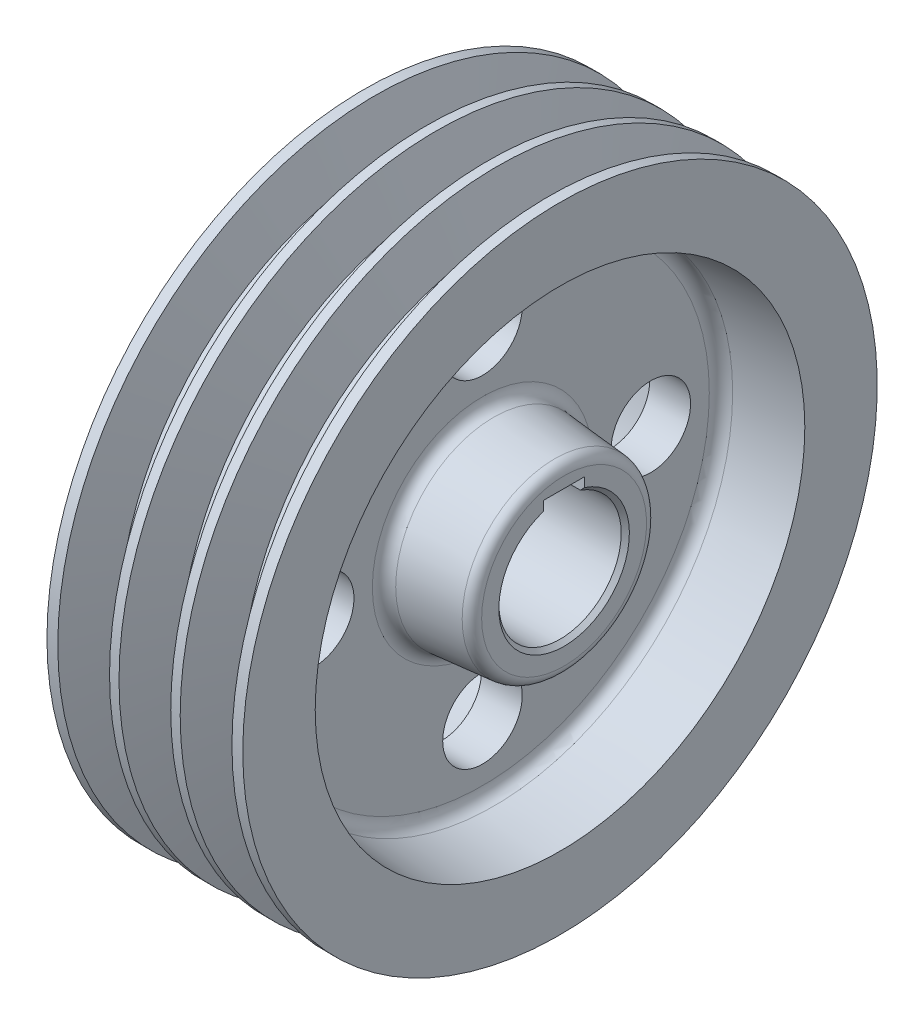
from build123d import *

# Parameters (mm, degrees)
PATTERN_LINEAR_936_COUNT    = 3
PATTERN_LINEAR_936_PITCH    = 15
CHAMFER_1_SIZE              = 1
SKETCH_4_W                  = 10
SKETCH_4_H                  = 3.357864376
CUT_EXTRUDE_1_DEPTH         = 121.789589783
FILLET_1_R                  = 3
FILLET_2_R                  = 2.5
SKETCH_5_R                  = 9.75
CUT_EXTRUDE_2_DEPTH         = 121.379088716
PATTERN_CIRCULAR_1727_COUNT = 4


with BuildPart() as part:
    # Sketch 1 → Revolve 1 (revolve)
    with BuildSketch(Plane.XY, mode=Mode.PRIVATE) as revolve_1_sk:
        Polygon((-1, 15), (-1, 22.5), (19, 24.249773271), (19, 58.337715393), (0, 60), (0, 77.75), (48, 77.75), (48, 60), (29, 58.337715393), (29, 24.249773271), (49, 22.5), (49, 15), align=None)
    revolve(revolve_1_sk.sketch.rotate(Axis((0, 0, 0), (1, 0, 0)), 90), axis=Axis((0, 0, 0), (1, 0, 0)))

    # Sketch 2 → Cut-Revolve 1 (revolve, cut)
    with BuildSketch(Plane.XY, mode=Mode.PRIVATE) as cut_revolve_1_sk:
        Polygon((11.840143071, 66.3), (15.340759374, 77.75), (2.659240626, 77.75), (6.159856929, 66.3), align=None)
    cut_revolve_1 = revolve(cut_revolve_1_sk.sketch.rotate(Axis((0, 0, 0), (1, 0, 0)), 90), axis=Axis((0, 0, 0), (1, 0, 0)), mode=Mode.SUBTRACT)

    # Pattern Linear 936: Cut-Revolve 1 ×3
    with Locations(*[(i * PATTERN_LINEAR_936_PITCH, 0, 0) for i in range(1, PATTERN_LINEAR_936_COUNT)]):
        add(cut_revolve_1, mode=Mode.SUBTRACT)

    # Chamfer 1
    chamfer_1_edges = [part.edges().sort_by_distance(p)[0] for p in [
        (-1, 0, -15),
        (49, 0, -15),
    ]]
    chamfer(chamfer_1_edges, length=CHAMFER_1_SIZE)

    # Sketch 4 → Cut-Extrude 1 (cut, through all)
    with BuildSketch(Plane.ZY.offset(1)):
        with Locations((0, 15.821067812)):
            Rectangle(SKETCH_4_W, SKETCH_4_H)
    extrude(amount=-CUT_EXTRUDE_1_DEPTH, mode=Mode.SUBTRACT)

    # Fillet 1
    fillet_1_edges = [part.edges().sort_by_distance(p)[0] for p in [
        (19, 0, -58.337715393),
        (19, 0, -24.249773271),
        (29, 0, -24.249773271),
        (29, 0, -58.337715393),
    ]]
    fillet(fillet_1_edges, radius=FILLET_1_R)

    # Fillet 2
    fillet_2_edges = [part.edges().sort_by_distance(p)[0] for p in [
        (-1, 0, -22.5),
        (49, 0, -22.5),
    ]]
    fillet(fillet_2_edges, radius=FILLET_2_R)

    # Sketch 5 → Cut-Extrude 2 (cut, through all)
    with BuildSketch(Plane(origin=(0, 0, 0), x_dir=(0, 0, -1), z_dir=(1, 0, 0))):
        with Locations(Location((0, 41.25, 0), (0, 0, 180))):
            Circle(SKETCH_5_R)
    cut_extrude_2 = extrude(amount=CUT_EXTRUDE_2_DEPTH, mode=Mode.SUBTRACT)

    # Pattern Circular 1727: Cut-Extrude 2 ×4 about axis
    pattern_circular_1727_axis = Axis((0, 0, 0), (1, 0, 0))
    for i in range(1, PATTERN_CIRCULAR_1727_COUNT):
        add(cut_extrude_2.rotate(pattern_circular_1727_axis, i * 360 / PATTERN_CIRCULAR_1727_COUNT), mode=Mode.SUBTRACT)


solid = part.part
